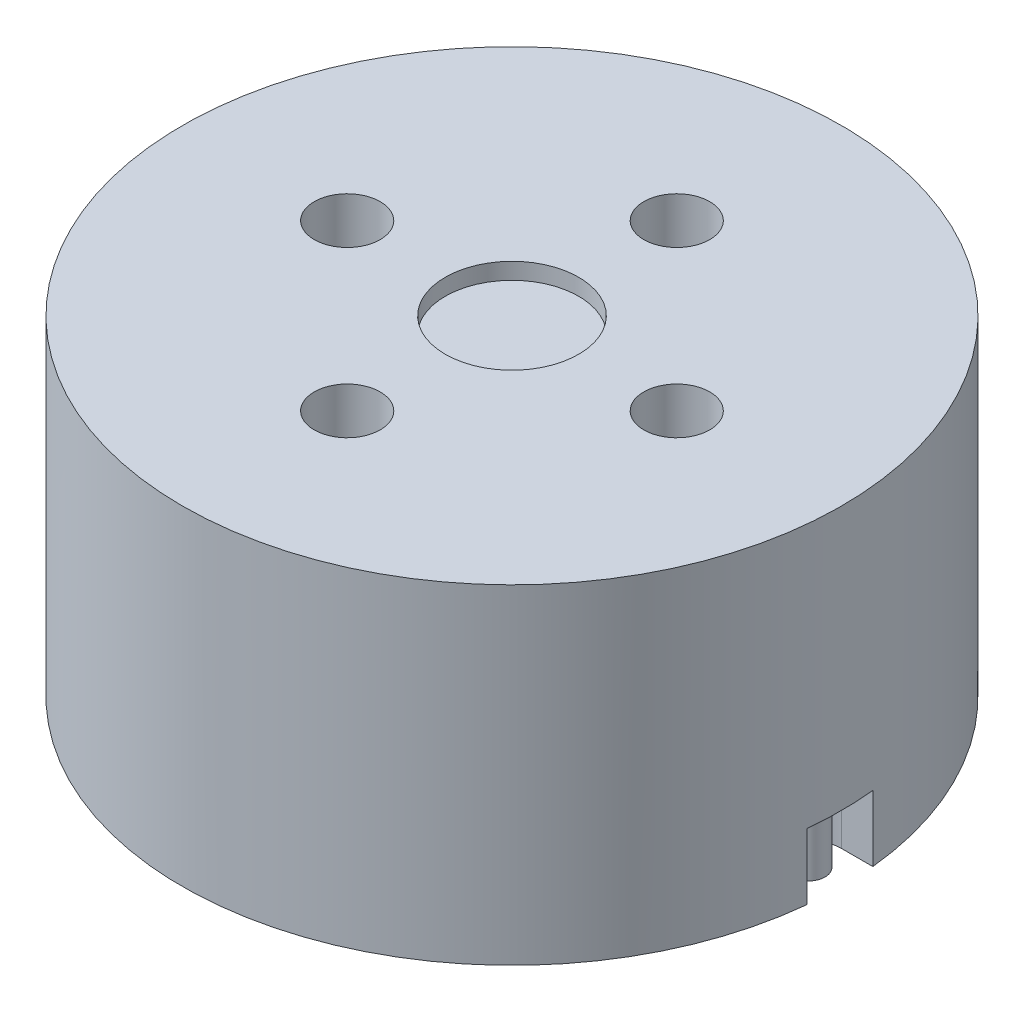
from build123d import *

# Parameters (mm, degrees)
SKETCH1_R           = 20
BOSS_EXTRUDE1_DEPTH = 20
SKETCH2_R           = 2
CUT_EXTRUDE1_DEPTH  = 35.641016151
SKETCH3_R           = 4.05
CUT_EXTRUDE2_DEPTH  = 1
SKETCH4_R           = 1
CUT_EXTRUDE3_DEPTH  = 4
SKETCH5_R           = 1
CUT_EXTRUDE4_DEPTH  = 4
BOSS_EXTRUDE2_START = 15
SKETCH6_R           = 1
BOSS_EXTRUDE2_DEPTH = 15


with BuildPart() as part:
    # Sketch1 → Boss-Extrude1 (new body)
    with BuildSketch(Plane(origin=(0, 0, 0), x_dir=(1, 0, 0), z_dir=(0, 1, 0))):
        with Locations(Location((0, 0, 0), (0, 0, 270))):
            Circle(SKETCH1_R)
    extrude(amount=BOSS_EXTRUDE1_DEPTH)

    # Sketch2 → Cut-Extrude1 (cut, through all)
    with BuildSketch(Plane(origin=(0, 20, 0), x_dir=(1, 0, 0), z_dir=(0, 1, 0))):
        with Locations(Location((0, 10, 0), (0, 0, 270))):
            Circle(SKETCH2_R)
        with Locations(Location((10, 0, 0), (0, 0, 270))):
            Circle(SKETCH2_R)
        with Locations(Location((0, -10, 0), (0, 0, 270))):
            Circle(SKETCH2_R)
        with Locations(Location((-10, 0, 0), (0, 0, 270))):
            Circle(SKETCH2_R)
    extrude(amount=-CUT_EXTRUDE1_DEPTH, mode=Mode.SUBTRACT)

    # Sketch3 → Cut-Extrude2 (cut)
    with BuildSketch(Plane(origin=(0, 20, 0), x_dir=(1, 0, 0), z_dir=(0, 1, 0))):
        with Locations(Location((0, 0, 0), (0, 0, 270))):
            Circle(SKETCH3_R)
    extrude(amount=-CUT_EXTRUDE2_DEPTH, mode=Mode.SUBTRACT)

    # Sketch4 → Cut-Extrude3 (cut)
    with BuildSketch(Plane.XZ):
        with Locations(Location((0, 0, 0), (0, 0, 270))):
            Circle(SKETCH4_R)
    extrude(amount=-CUT_EXTRUDE3_DEPTH, mode=Mode.SUBTRACT)

    # Sketch5 → Cut-Extrude4 (cut)
    # profile 1 of 2: a face of its own
    with BuildSketch(Plane(origin=(0, 0, 0), x_dir=(-1, 0, 0), z_dir=(0, -1, 0))):
        with BuildLine():
            Line((18, -2), (19.899748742, -2))
            ThreePointArc((19.899748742, -2), (20, 0), (19.899748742, 2))
            Line((19.899748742, 2), (18, 2))
            ThreePointArc((18, 2), (16, 0), (18, -2))
        make_face()
        with Locations(Location((18, 0, 0), (0, 0, 90))):
            Circle(SKETCH5_R, mode=Mode.SUBTRACT)
    # profile 2 of 2: a face of its own
    with BuildSketch(Plane(origin=(0, 0, 0), x_dir=(-1, 0, 0), z_dir=(0, -1, 0))):
        with BuildLine():
            Line((-18, 2), (-19.899748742, 2))
            ThreePointArc((-19.899748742, 2), (-20, 0), (-19.899748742, -2))
            Line((-19.899748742, -2), (-18, -2))
            ThreePointArc((-18, -2), (-16, 0), (-18, 2))
        make_face()
        with Locations(Location((-18, 0, 0), (0, 0, 270))):
            Circle(SKETCH5_R, mode=Mode.SUBTRACT)
    extrude(amount=-CUT_EXTRUDE4_DEPTH, mode=Mode.SUBTRACT)

    # Sketch6 → Boss-Extrude2 (add)
    with BuildSketch(Plane(origin=(0, 4, 0), x_dir=(-1, 0, 0), z_dir=(0, -1, 0)).offset(BOSS_EXTRUDE2_START)):
        with Locations(Location((0, 0, 0), (0, 0, 90))):
            Circle(SKETCH6_R)
    extrude(amount=-BOSS_EXTRUDE2_DEPTH)


solid = part.part
